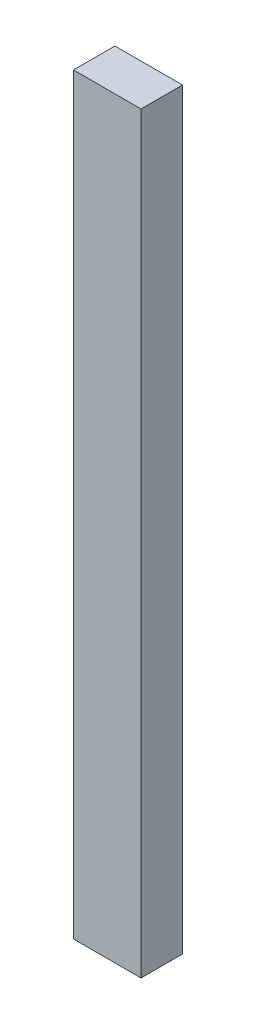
ISO-10303-21;
HEADER;
FILE_DESCRIPTION(('STEP AP214'),'2;1');
FILE_NAME('part.step','',(''),(''),'','','');
FILE_SCHEMA(('AUTOMOTIVE_DESIGN { 1 0 10303 214 1 1 1 1 }'));
ENDSEC;
DATA;
#1=APPLICATION_CONTEXT('core data for automotive mechanical design processes');
#2=APPLICATION_PROTOCOL_DEFINITION('international standard','automotive_design',2000,#1);
#3=PRODUCT_CONTEXT('',#1,'mechanical');
#4=PRODUCT('Part','Part','',(#3));
#5=PRODUCT_RELATED_PRODUCT_CATEGORY('part','',(#4));
#6=PRODUCT_DEFINITION_FORMATION('','',#4);
#7=PRODUCT_DEFINITION_CONTEXT('part definition',#1,'design');
#8=PRODUCT_DEFINITION('design','',#6,#7);
#9=PRODUCT_DEFINITION_SHAPE('','',#8);
#10=(LENGTH_UNIT() NAMED_UNIT(*) SI_UNIT(.MILLI.,.METRE.));
#11=(NAMED_UNIT(*) PLANE_ANGLE_UNIT() SI_UNIT($,.RADIAN.));
#12=(NAMED_UNIT(*) SI_UNIT($,.STERADIAN.) SOLID_ANGLE_UNIT());
#13=UNCERTAINTY_MEASURE_WITH_UNIT(LENGTH_MEASURE(1.E-05),#10,'distance_accuracy_value','');
#14=(GEOMETRIC_REPRESENTATION_CONTEXT(3) GLOBAL_UNCERTAINTY_ASSIGNED_CONTEXT((#13)) GLOBAL_UNIT_ASSIGNED_CONTEXT((#10,
#11,#12)) REPRESENTATION_CONTEXT('',''));
#15=CARTESIAN_POINT('',(0.,0.,0.));
#16=DIRECTION('',(0.,0.,1.));
#17=DIRECTION('',(1.,0.,0.));
#18=AXIS2_PLACEMENT_3D('',#15,#16,#17);
#19=CARTESIAN_POINT('',(35.,780.,-21.5));
#20=DIRECTION('',(-1.,0.,0.));
#21=DIRECTION('',(0.,0.,1.));
#22=AXIS2_PLACEMENT_3D('',#19,#20,#21);
#23=PLANE('',#22);
#24=DIRECTION('',(0.,0.,-1.));
#25=VECTOR('',#24,1.);
#26=CARTESIAN_POINT('',(35.,0.,-21.5));
#27=LINE('',#26,#25);
#28=CARTESIAN_POINT('',(35.,0.,21.5));
#29=VERTEX_POINT('',#28);
#30=CARTESIAN_POINT('',(35.,0.,-21.5));
#31=VERTEX_POINT('',#30);
#32=EDGE_CURVE('E95',#29,#31,#27,.T.);
#33=ORIENTED_EDGE('',*,*,#32,.T.);
#34=DIRECTION('',(0.,-1.,0.));
#35=VECTOR('',#34,1.);
#36=CARTESIAN_POINT('',(35.,780.,-21.5));
#37=LINE('',#36,#35);
#38=CARTESIAN_POINT('',(35.,780.,-21.5));
#39=VERTEX_POINT('',#38);
#40=EDGE_CURVE('E11',#39,#31,#37,.T.);
#41=ORIENTED_EDGE('',*,*,#40,.F.);
#42=DIRECTION('',(0.,0.,-1.));
#43=VECTOR('',#42,1.);
#44=CARTESIAN_POINT('',(35.,780.,-21.5));
#45=LINE('',#44,#43);
#46=CARTESIAN_POINT('',(35.,780.,21.5));
#47=VERTEX_POINT('',#46);
#48=EDGE_CURVE('E83',#47,#39,#45,.T.);
#49=ORIENTED_EDGE('',*,*,#48,.F.);
#50=DIRECTION('',(0.,-1.,0.));
#51=VECTOR('',#50,1.);
#52=CARTESIAN_POINT('',(35.,780.,21.5));
#53=LINE('',#52,#51);
#54=EDGE_CURVE('E91',#47,#29,#53,.T.);
#55=ORIENTED_EDGE('',*,*,#54,.T.);
#56=EDGE_LOOP('',(#33,#41,#49,#55));
#57=FACE_BOUND('',#56,.T.);
#58=ADVANCED_FACE('F32',(#57),#23,.F.);
#59=CARTESIAN_POINT('',(-35.,780.,-21.5));
#60=DIRECTION('',(0.,0.,1.));
#61=DIRECTION('',(1.,0.,0.));
#62=AXIS2_PLACEMENT_3D('',#59,#60,#61);
#63=PLANE('',#62);
#64=DIRECTION('',(-1.,0.,0.));
#65=VECTOR('',#64,1.);
#66=CARTESIAN_POINT('',(-35.,0.,-21.5));
#67=LINE('',#66,#65);
#68=CARTESIAN_POINT('',(-35.,0.,-21.5));
#69=VERTEX_POINT('',#68);
#70=EDGE_CURVE('E87',#31,#69,#67,.T.);
#71=ORIENTED_EDGE('',*,*,#70,.T.);
#72=DIRECTION('',(0.,-1.,0.));
#73=VECTOR('',#72,1.);
#74=CARTESIAN_POINT('',(-35.,780.,-21.5));
#75=LINE('',#74,#73);
#76=CARTESIAN_POINT('',(-35.,780.,-21.5));
#77=VERTEX_POINT('',#76);
#78=EDGE_CURVE('E40',#77,#69,#75,.T.);
#79=ORIENTED_EDGE('',*,*,#78,.F.);
#80=DIRECTION('',(-1.,0.,0.));
#81=VECTOR('',#80,1.);
#82=CARTESIAN_POINT('',(-35.,780.,-21.5));
#83=LINE('',#82,#81);
#84=EDGE_CURVE('E78',#39,#77,#83,.T.);
#85=ORIENTED_EDGE('',*,*,#84,.F.);
#86=ORIENTED_EDGE('',*,*,#40,.T.);
#87=EDGE_LOOP('',(#71,#79,#85,#86));
#88=FACE_BOUND('',#87,.T.);
#89=ADVANCED_FACE('F86',(#88),#63,.F.);
#90=CARTESIAN_POINT('',(-35.,780.,-21.5));
#91=DIRECTION('',(1.,0.,0.));
#92=DIRECTION('',(0.,0.,-1.));
#93=AXIS2_PLACEMENT_3D('',#90,#91,#92);
#94=PLANE('',#93);
#95=DIRECTION('',(0.,0.,1.));
#96=VECTOR('',#95,1.);
#97=CARTESIAN_POINT('',(-35.,0.,-21.5));
#98=LINE('',#97,#96);
#99=CARTESIAN_POINT('',(-35.,0.,21.5));
#100=VERTEX_POINT('',#99);
#101=EDGE_CURVE('E65',#69,#100,#98,.T.);
#102=ORIENTED_EDGE('',*,*,#101,.T.);
#103=DIRECTION('',(0.,-1.,0.));
#104=VECTOR('',#103,1.);
#105=CARTESIAN_POINT('',(-35.,780.,21.5));
#106=LINE('',#105,#104);
#107=CARTESIAN_POINT('',(-35.,780.,21.5));
#108=VERTEX_POINT('',#107);
#109=EDGE_CURVE('E88',#108,#100,#106,.T.);
#110=ORIENTED_EDGE('',*,*,#109,.F.);
#111=DIRECTION('',(0.,0.,1.));
#112=VECTOR('',#111,1.);
#113=CARTESIAN_POINT('',(-35.,780.,-21.5));
#114=LINE('',#113,#112);
#115=EDGE_CURVE('E81',#77,#108,#114,.T.);
#116=ORIENTED_EDGE('',*,*,#115,.F.);
#117=ORIENTED_EDGE('',*,*,#78,.T.);
#118=EDGE_LOOP('',(#102,#110,#116,#117));
#119=FACE_BOUND('',#118,.T.);
#120=ADVANCED_FACE('F89',(#119),#94,.F.);
#121=CARTESIAN_POINT('',(-35.,780.,21.5));
#122=DIRECTION('',(0.,0.,-1.));
#123=DIRECTION('',(-1.,0.,0.));
#124=AXIS2_PLACEMENT_3D('',#121,#122,#123);
#125=PLANE('',#124);
#126=DIRECTION('',(1.,0.,0.));
#127=VECTOR('',#126,1.);
#128=CARTESIAN_POINT('',(-35.,0.,21.5));
#129=LINE('',#128,#127);
#130=EDGE_CURVE('E71',#100,#29,#129,.T.);
#131=ORIENTED_EDGE('',*,*,#130,.T.);
#132=ORIENTED_EDGE('',*,*,#54,.F.);
#133=DIRECTION('',(1.,0.,0.));
#134=VECTOR('',#133,1.);
#135=CARTESIAN_POINT('',(-35.,780.,21.5));
#136=LINE('',#135,#134);
#137=EDGE_CURVE('E48',#108,#47,#136,.T.);
#138=ORIENTED_EDGE('',*,*,#137,.F.);
#139=ORIENTED_EDGE('',*,*,#109,.T.);
#140=EDGE_LOOP('',(#131,#132,#138,#139));
#141=FACE_BOUND('',#140,.T.);
#142=ADVANCED_FACE('F102',(#141),#125,.F.);
#143=CARTESIAN_POINT('',(0.,780.,0.));
#144=DIRECTION('',(0.,1.,0.));
#145=DIRECTION('',(0.,0.,1.));
#146=AXIS2_PLACEMENT_3D('',#143,#144,#145);
#147=PLANE('',#146);
#148=ORIENTED_EDGE('',*,*,#48,.T.);
#149=ORIENTED_EDGE('',*,*,#84,.T.);
#150=ORIENTED_EDGE('',*,*,#115,.T.);
#151=ORIENTED_EDGE('',*,*,#137,.T.);
#152=EDGE_LOOP('',(#148,#149,#150,#151));
#153=FACE_BOUND('',#152,.T.);
#154=ADVANCED_FACE('F79',(#153),#147,.T.);
#155=CARTESIAN_POINT('',(0.,0.,0.));
#156=DIRECTION('',(0.,1.,0.));
#157=DIRECTION('',(0.,0.,1.));
#158=AXIS2_PLACEMENT_3D('',#155,#156,#157);
#159=PLANE('',#158);
#160=ORIENTED_EDGE('',*,*,#32,.F.);
#161=ORIENTED_EDGE('',*,*,#130,.F.);
#162=ORIENTED_EDGE('',*,*,#101,.F.);
#163=ORIENTED_EDGE('',*,*,#70,.F.);
#164=EDGE_LOOP('',(#160,#161,#162,#163));
#165=FACE_BOUND('',#164,.T.);
#166=ADVANCED_FACE('F105',(#165),#159,.F.);
#167=CLOSED_SHELL('',(#58,#89,#120,#142,#154,#166));
#168=MANIFOLD_SOLID_BREP('B2',#167);
#169=ADVANCED_BREP_SHAPE_REPRESENTATION('',(#18,#168),#14);
#170=SHAPE_DEFINITION_REPRESENTATION(#9,#169);
ENDSEC;
END-ISO-10303-21;
